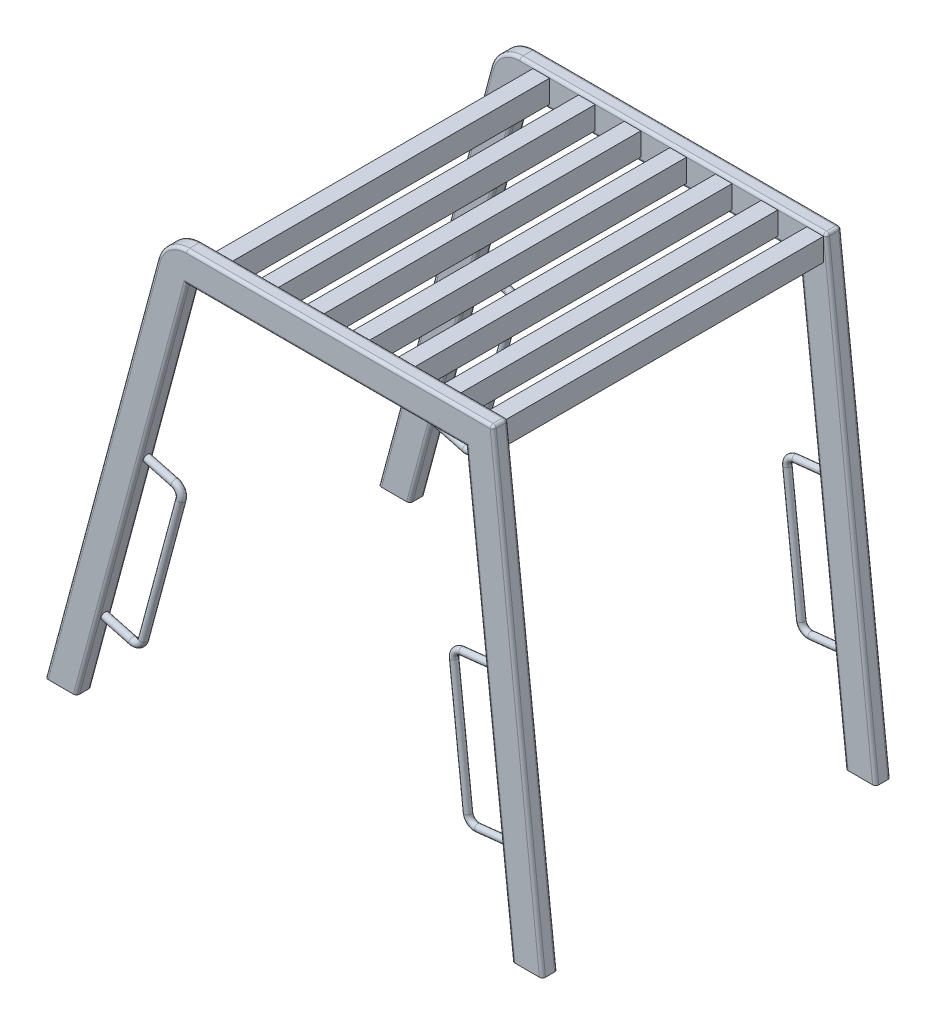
from build123d import *

# Parameters (mm, degrees)
BOSS_EXTRUDE1_DEPTH = 50
FILLET1_R           = 10
SKETCH6_R           = 12
SKETCH9_R           = 11
LPATTERN1_COUNT     = 2
LPATTERN1_PITCH     = 1095
SKETCH10_W          = 54.451264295
SKETCH10_H          = 74.518037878
BOSS_EXTRUDE2_DEPTH = 1045
LPATTERN8_COUNT     = 7
LPATTERN8_PITCH     = 150


with BuildPart() as part:
    # Sketch1 → Boss-Extrude1 (new body)
    with BuildSketch(Plane.XY):
        with BuildLine():
            Line((103.527618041, 0), (465.259027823, 1350))
            Line((465.259027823, 1350), (1381.907544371, 1350))
            Line((1381.907544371, 1350), (1522.849474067, 60))
            Line((1522.849474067, 60), (1533.775205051, -40))
            Line((1533.775205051, -40), (1634.370292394, -40))
            Line((1634.370292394, -40), (1630, 0))
            Line((1630, 0), (1471.576900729, 1450))
            Line((1471.576900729, 1450), (465.259027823, 1450))
            ThreePointArc((465.259027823, 1450), (404.382884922, 1429.335334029), (368.666445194, 1375.88190451))
            Line((368.666445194, 1375.88190451), (0, 0))
            Line((0, 0), (103.527618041, 0))
        make_face()
    extrude(amount=BOSS_EXTRUDE1_DEPTH)

    # Fillet1
    fillet1_edges = [part.edges().sort_by_distance(p)[0] for p in [
        (968.417964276, 1450, 0),
        (1552.973596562, 705, 0),
        (1457.841374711, 655, 0),
        (923.583286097, 1350, 0),
        (284.393322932, 675, 0),
        (184.333222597, 687.940952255, 0),
        (404.382884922, 1429.335334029, 0),
        (284.393322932, 675, 50),
        (1471.576900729, 1450, 25),
        (923.583286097, 1350, 50),
        (1457.841374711, 655, 50),
        (1552.973596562, 705, 50),
        (968.417964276, 1450, 50),
        (404.382884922, 1429.335334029, 50),
        (184.333222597, 687.940952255, 50),
    ]]
    fillet(fillet1_edges, radius=FILLET1_R)

    # Sweep1: sweep along a path in Sketch7
    with BuildLine(Plane(origin=(0, 0, 25), x_dir=(-1, 0, 0), z_dir=(0, 0, -1))) as sweep1_path:
        Line((-170.670209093, 250.579561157), (-262.152045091, 226.067077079))
        ThreePointArc((-262.152045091, 226.067077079), (-284.916616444, 229.064089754), (-298.894391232, 247.280280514))
        Line((-298.894391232, 247.280280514), (-422.179558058, 707.386786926))
        ThreePointArc((-422.179558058, 707.386786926), (-419.182545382, 730.151358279), (-400.966354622, 744.129133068))
        Line((-400.966354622, 744.129133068), (-299.829188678, 771.228755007))
    # Sketch6 → Sweep1 (sweep)
    with BuildSketch(Plane(origin=(96.592582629, -25.88190451, 0), x_dir=(0, 0, -1), z_dir=(0.9659258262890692, -0.25881904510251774, 0))):
        with Locations((-25, 286.213970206)):
            Circle(SKETCH6_R)
    sweep(path=sweep1_path.line)

    # Sweep2: sweep along a path in Sketch8
    with BuildLine(Plane(origin=(0, 0, 25), x_dir=(-1, 0, 0), z_dir=(0, 0, -1))) as sweep2_path:
        Line((-1497.827847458, 270.97004794), (-1397.784130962, 260.03954061))
        ThreePointArc((-1397.784130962, 260.03954061), (-1375.742075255, 266.470370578), (-1364.703271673, 286.603741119))
        Line((-1364.703271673, 286.603741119), (-1319.08666022, 704.119159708))
        ThreePointArc((-1319.08666022, 704.119159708), (-1325.517490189, 726.161215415), (-1345.65086073, 737.200018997))
        Line((-1345.65086073, 737.200018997), (-1447.642926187, 748.343397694))
    # Sketch9 → Sweep2 (sweep)
    with BuildSketch(Plane(origin=(1511.363524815, 165.127512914, 0), x_dir=(0, 0, 1), z_dir=(-0.9940843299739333, -0.10861097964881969, 0))):
        with Locations((25, 586.686528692)):
            Circle(SKETCH9_R)
    sweep(path=sweep2_path.line)


with BuildPart() as lpattern1_1:
    # LPattern1: pattern copy
    add(part.part.moved(Location(Vector(0, 0, 1) * (1 * LPATTERN1_PITCH))))


with BuildPart() as part_1:
    add(part.part)

    add(lpattern1_1.part)  # Boss-Extrude2 merges LPattern1_1
    # Sketch10 → Boss-Extrude2 (add)
    with BuildSketch(Plane.XY.offset(50)):
        with Locations((1435.384332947, 1402.740981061)):
            Rectangle(SKETCH10_W, SKETCH10_H)
    boss_extrude2 = extrude(amount=BOSS_EXTRUDE2_DEPTH)

    # LPattern8: Boss-Extrude2 ×7
    with Locations(*[(-i * LPATTERN8_PITCH, 0, 0) for i in range(1, LPATTERN8_COUNT)]):
        add(boss_extrude2)


solid = part_1.part
